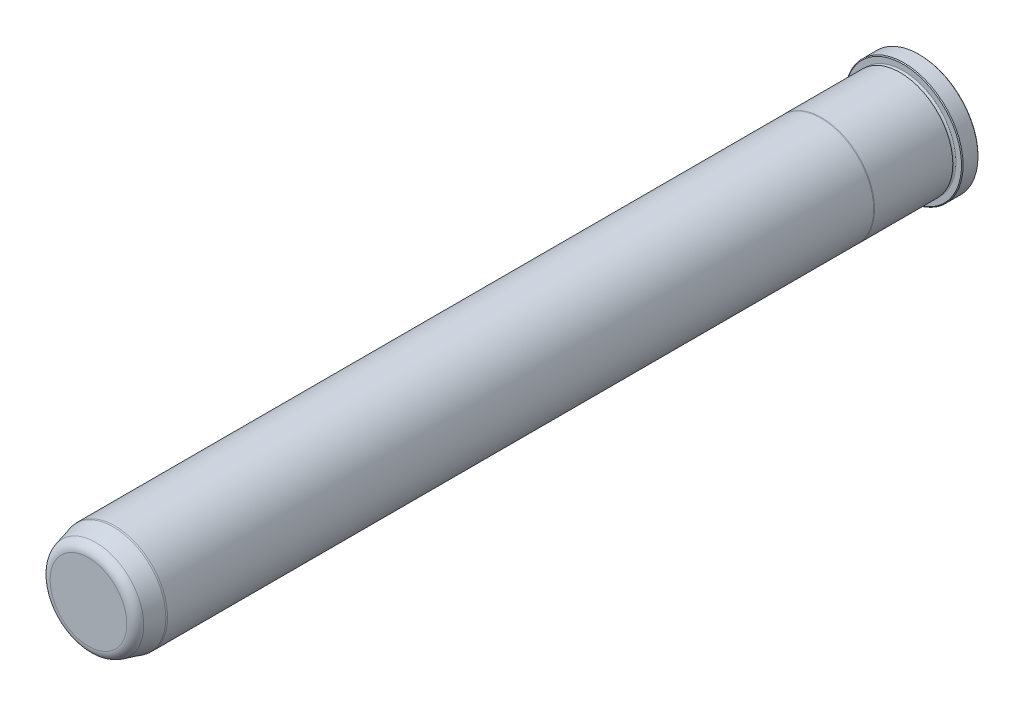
ISO-10303-21;
HEADER;
FILE_DESCRIPTION(('STEP AP214'),'2;1');
FILE_NAME('part.step','',(''),(''),'','','');
FILE_SCHEMA(('AUTOMOTIVE_DESIGN { 1 0 10303 214 1 1 1 1 }'));
ENDSEC;
DATA;
#1=APPLICATION_CONTEXT('core data for automotive mechanical design processes');
#2=APPLICATION_PROTOCOL_DEFINITION('international standard','automotive_design',2000,#1);
#3=PRODUCT_CONTEXT('',#1,'mechanical');
#4=PRODUCT('Part','Part','',(#3));
#5=PRODUCT_RELATED_PRODUCT_CATEGORY('part','',(#4));
#6=PRODUCT_DEFINITION_FORMATION('','',#4);
#7=PRODUCT_DEFINITION_CONTEXT('part definition',#1,'design');
#8=PRODUCT_DEFINITION('design','',#6,#7);
#9=PRODUCT_DEFINITION_SHAPE('','',#8);
#10=(LENGTH_UNIT() NAMED_UNIT(*) SI_UNIT(.MILLI.,.METRE.));
#11=(NAMED_UNIT(*) PLANE_ANGLE_UNIT() SI_UNIT($,.RADIAN.));
#12=(NAMED_UNIT(*) SI_UNIT($,.STERADIAN.) SOLID_ANGLE_UNIT());
#13=UNCERTAINTY_MEASURE_WITH_UNIT(LENGTH_MEASURE(1.E-05),#10,'distance_accuracy_value','');
#14=(GEOMETRIC_REPRESENTATION_CONTEXT(3) GLOBAL_UNCERTAINTY_ASSIGNED_CONTEXT((#13)) GLOBAL_UNIT_ASSIGNED_CONTEXT((#10,
#11,#12)) REPRESENTATION_CONTEXT('',''));
#15=CARTESIAN_POINT('',(0.,0.,0.));
#16=DIRECTION('',(0.,0.,1.));
#17=DIRECTION('',(1.,0.,0.));
#18=AXIS2_PLACEMENT_3D('',#15,#16,#17);
#19=CARTESIAN_POINT('',(0.,0.,0.));
#20=DIRECTION('',(0.,0.,1.));
#21=DIRECTION('',(1.,0.,0.));
#22=AXIS2_PLACEMENT_3D('',#19,#20,#21);
#23=PLANE('',#22);
#24=CARTESIAN_POINT('',(0.,0.,0.));
#25=DIRECTION('',(0.,0.,1.));
#26=DIRECTION('',(1.,0.,0.));
#27=AXIS2_PLACEMENT_3D('',#24,#25,#26);
#28=CIRCLE('',#27,28.067);
#29=CARTESIAN_POINT('',(28.067,0.,0.));
#30=VERTEX_POINT('',#29);
#31=EDGE_CURVE('E37',#30,#30,#28,.F.);
#32=ORIENTED_EDGE('',*,*,#31,.T.);
#33=EDGE_LOOP('',(#32));
#34=FACE_BOUND('',#33,.T.);
#35=ADVANCED_FACE('F30',(#34),#23,.F.);
#36=CARTESIAN_POINT('',(0.,0.,0.));
#37=DIRECTION('',(0.,0.,1.));
#38=DIRECTION('',(1.,0.,0.));
#39=AXIS2_PLACEMENT_3D('',#36,#37,#38);
#40=CYLINDRICAL_SURFACE('',#39,28.448);
#41=CARTESIAN_POINT('',(0.,0.,0.380999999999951));
#42=DIRECTION('',(0.,0.,1.));
#43=DIRECTION('',(1.,0.,0.));
#44=AXIS2_PLACEMENT_3D('',#41,#42,#43);
#45=CIRCLE('',#44,28.448);
#46=CARTESIAN_POINT('',(28.448,0.,0.380999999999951));
#47=VERTEX_POINT('',#46);
#48=EDGE_CURVE('E41',#47,#47,#45,.T.);
#49=ORIENTED_EDGE('',*,*,#48,.T.);
#50=EDGE_LOOP('',(#49));
#51=FACE_BOUND('',#50,.T.);
#52=CARTESIAN_POINT('',(0.,0.,7.54379999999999));
#53=DIRECTION('',(0.,0.,-1.));
#54=DIRECTION('',(-1.,0.,0.));
#55=AXIS2_PLACEMENT_3D('',#52,#53,#54);
#56=CIRCLE('',#55,28.448);
#57=CARTESIAN_POINT('',(-28.448,0.,7.54379999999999));
#58=VERTEX_POINT('',#57);
#59=EDGE_CURVE('E45',#58,#58,#56,.T.);
#60=ORIENTED_EDGE('',*,*,#59,.T.);
#61=EDGE_LOOP('',(#60));
#62=FACE_BOUND('',#61,.T.);
#63=ADVANCED_FACE('F118',(#51,#62),#40,.T.);
#64=CARTESIAN_POINT('',(0.,28.448,7.9248));
#65=DIRECTION('',(0.,0.,-1.));
#66=DIRECTION('',(-1.,0.,0.));
#67=AXIS2_PLACEMENT_3D('',#64,#65,#66);
#68=PLANE('',#67);
#69=CARTESIAN_POINT('',(0.,0.,7.9248));
#70=DIRECTION('',(0.,0.,-1.));
#71=DIRECTION('',(-1.,0.,0.));
#72=AXIS2_PLACEMENT_3D('',#69,#70,#71);
#73=CIRCLE('',#72,28.067);
#74=CARTESIAN_POINT('',(-28.067,0.,7.9248));
#75=VERTEX_POINT('',#74);
#76=EDGE_CURVE('E10',#75,#75,#73,.F.);
#77=ORIENTED_EDGE('',*,*,#76,.T.);
#78=EDGE_LOOP('',(#77));
#79=FACE_BOUND('',#78,.T.);
#80=CARTESIAN_POINT('',(0.,0.,7.9248));
#81=DIRECTION('',(0.,0.,1.));
#82=DIRECTION('',(1.,0.,0.));
#83=AXIS2_PLACEMENT_3D('',#80,#81,#82);
#84=CIRCLE('',#83,25.3873);
#85=CARTESIAN_POINT('',(25.3873,0.,7.9248));
#86=VERTEX_POINT('',#85);
#87=EDGE_CURVE('E56',#86,#86,#84,.T.);
#88=ORIENTED_EDGE('',*,*,#87,.F.);
#89=EDGE_LOOP('',(#88));
#90=FACE_BOUND('',#89,.T.);
#91=ADVANCED_FACE('F113',(#79,#90),#68,.F.);
#92=CARTESIAN_POINT('',(0.,0.,8.6868));
#93=DIRECTION('',(0.,0.,1.));
#94=DIRECTION('',(1.,0.,0.));
#95=AXIS2_PLACEMENT_3D('',#92,#93,#94);
#96=TOROIDAL_SURFACE('',#95,25.3873,0.761999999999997);
#97=CARTESIAN_POINT('',(0.,0.,9.44879999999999));
#98=DIRECTION('',(0.,0.,1.));
#99=DIRECTION('',(1.,0.,0.));
#100=AXIS2_PLACEMENT_3D('',#97,#98,#99);
#101=CIRCLE('',#100,25.3873);
#102=CARTESIAN_POINT('',(25.3873,0.,9.44879999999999));
#103=VERTEX_POINT('',#102);
#104=EDGE_CURVE('E59',#103,#103,#101,.T.);
#105=ORIENTED_EDGE('',*,*,#104,.F.);
#106=EDGE_LOOP('',(#105));
#107=FACE_BOUND('',#106,.T.);
#108=ORIENTED_EDGE('',*,*,#87,.T.);
#109=EDGE_LOOP('',(#108));
#110=FACE_BOUND('',#109,.T.);
#111=ADVANCED_FACE('F107',(#107,#110),#96,.F.);
#112=CARTESIAN_POINT('',(0.,25.3873,9.44879999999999));
#113=DIRECTION('',(0.,0.,1.));
#114=DIRECTION('',(1.,0.,0.));
#115=AXIS2_PLACEMENT_3D('',#112,#113,#114);
#116=PLANE('',#115);
#117=CARTESIAN_POINT('',(0.,0.,9.4488));
#118=DIRECTION('',(0.,0.,1.));
#119=DIRECTION('',(1.,0.,0.));
#120=AXIS2_PLACEMENT_3D('',#117,#118,#119);
#121=CIRCLE('',#120,25.4127);
#122=CARTESIAN_POINT('',(25.4127,0.,9.4488));
#123=VERTEX_POINT('',#122);
#124=EDGE_CURVE('E62',#123,#123,#121,.T.);
#125=ORIENTED_EDGE('',*,*,#124,.F.);
#126=EDGE_LOOP('',(#125));
#127=FACE_BOUND('',#126,.T.);
#128=ORIENTED_EDGE('',*,*,#104,.T.);
#129=EDGE_LOOP('',(#128));
#130=FACE_BOUND('',#129,.T.);
#131=ADVANCED_FACE('F101',(#127,#130),#116,.F.);
#132=CARTESIAN_POINT('',(0.,0.,0.));
#133=DIRECTION('',(0.,0.,1.));
#134=DIRECTION('',(1.,0.,0.));
#135=AXIS2_PLACEMENT_3D('',#132,#133,#134);
#136=CYLINDRICAL_SURFACE('',#135,25.4127);
#137=CARTESIAN_POINT('',(0.,0.,47.1347630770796));
#138=DIRECTION('',(0.,0.,1.));
#139=DIRECTION('',(1.,0.,0.));
#140=AXIS2_PLACEMENT_3D('',#137,#138,#139);
#141=CIRCLE('',#140,25.4127);
#142=CARTESIAN_POINT('',(25.4127,0.,47.1347630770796));
#143=VERTEX_POINT('',#142);
#144=EDGE_CURVE('E65',#143,#143,#141,.T.);
#145=ORIENTED_EDGE('',*,*,#144,.F.);
#146=EDGE_LOOP('',(#145));
#147=FACE_BOUND('',#146,.T.);
#148=ORIENTED_EDGE('',*,*,#124,.T.);
#149=EDGE_LOOP('',(#148));
#150=FACE_BOUND('',#149,.T.);
#151=ADVANCED_FACE('F95',(#147,#150),#136,.T.);
#152=CARTESIAN_POINT('',(0.,0.,47.1347630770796));
#153=DIRECTION('',(0.,0.,-1.));
#154=DIRECTION('',(-1.,0.,0.));
#155=AXIS2_PLACEMENT_3D('',#152,#153,#154);
#156=CONICAL_SURFACE('',#155,25.4127,0.0698131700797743);
#157=CARTESIAN_POINT('',(0.,0.,47.498));
#158=DIRECTION('',(0.,0.,1.));
#159=DIRECTION('',(1.,0.,0.));
#160=AXIS2_PLACEMENT_3D('',#157,#158,#159);
#161=CIRCLE('',#160,25.3873);
#162=CARTESIAN_POINT('',(25.3873,0.,47.498));
#163=VERTEX_POINT('',#162);
#164=EDGE_CURVE('E68',#163,#163,#161,.T.);
#165=ORIENTED_EDGE('',*,*,#164,.F.);
#166=EDGE_LOOP('',(#165));
#167=FACE_BOUND('',#166,.T.);
#168=ORIENTED_EDGE('',*,*,#144,.T.);
#169=EDGE_LOOP('',(#168));
#170=FACE_BOUND('',#169,.T.);
#171=ADVANCED_FACE('F89',(#167,#170),#156,.T.);
#172=CARTESIAN_POINT('',(0.,0.,0.));
#173=DIRECTION('',(0.,0.,1.));
#174=DIRECTION('',(1.,0.,0.));
#175=AXIS2_PLACEMENT_3D('',#172,#173,#174);
#176=CYLINDRICAL_SURFACE('',#175,25.3873);
#177=CARTESIAN_POINT('',(0.,0.,387.35));
#178=DIRECTION('',(0.,0.,1.));
#179=DIRECTION('',(1.,0.,0.));
#180=AXIS2_PLACEMENT_3D('',#177,#178,#179);
#181=CIRCLE('',#180,25.3873);
#182=CARTESIAN_POINT('',(25.3873,0.,387.35));
#183=VERTEX_POINT('',#182);
#184=EDGE_CURVE('E71',#183,#183,#181,.T.);
#185=ORIENTED_EDGE('',*,*,#184,.F.);
#186=EDGE_LOOP('',(#185));
#187=FACE_BOUND('',#186,.T.);
#188=ORIENTED_EDGE('',*,*,#164,.T.);
#189=EDGE_LOOP('',(#188));
#190=FACE_BOUND('',#189,.T.);
#191=ADVANCED_FACE('F83',(#187,#190),#176,.T.);
#192=CARTESIAN_POINT('',(0.,0.,387.35));
#193=DIRECTION('',(0.,0.,-1.));
#194=DIRECTION('',(-1.,0.,0.));
#195=AXIS2_PLACEMENT_3D('',#192,#193,#194);
#196=CONICAL_SURFACE('',#195,25.3873,0.0872664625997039);
#197=CARTESIAN_POINT('',(0.,0.,388.112));
#198=DIRECTION('',(0.,0.,1.));
#199=DIRECTION('',(1.,0.,0.));
#200=AXIS2_PLACEMENT_3D('',#197,#198,#199);
#201=CIRCLE('',#200,25.3206336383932);
#202=CARTESIAN_POINT('',(25.3206336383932,0.,388.112));
#203=VERTEX_POINT('',#202);
#204=EDGE_CURVE('E74',#203,#203,#201,.T.);
#205=ORIENTED_EDGE('',*,*,#204,.F.);
#206=EDGE_LOOP('',(#205));
#207=FACE_BOUND('',#206,.T.);
#208=ORIENTED_EDGE('',*,*,#184,.T.);
#209=EDGE_LOOP('',(#208));
#210=FACE_BOUND('',#209,.T.);
#211=ADVANCED_FACE('F80',(#207,#210),#196,.T.);
#212=CARTESIAN_POINT('',(0.,0.,388.112));
#213=DIRECTION('',(0.,0.,-1.));
#214=DIRECTION('',(-1.,0.,0.));
#215=AXIS2_PLACEMENT_3D('',#212,#213,#214);
#216=CONICAL_SURFACE('',#215,25.3206336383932,0.26179938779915);
#217=CARTESIAN_POINT('',(0.,0.,396.520125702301));
#218=DIRECTION('',(0.,0.,1.));
#219=DIRECTION('',(1.,0.,0.));
#220=AXIS2_PLACEMENT_3D('',#217,#218,#219);
#221=CIRCLE('',#220,23.0676831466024);
#222=CARTESIAN_POINT('',(23.0676831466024,0.,396.520125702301));
#223=VERTEX_POINT('',#222);
#224=EDGE_CURVE('E50',#223,#223,#221,.F.);
#225=ORIENTED_EDGE('',*,*,#224,.T.);
#226=EDGE_LOOP('',(#225));
#227=FACE_BOUND('',#226,.T.);
#228=ORIENTED_EDGE('',*,*,#204,.T.);
#229=EDGE_LOOP('',(#228));
#230=FACE_BOUND('',#229,.T.);
#231=ADVANCED_FACE('F78',(#227,#230),#216,.T.);
#232=CARTESIAN_POINT('',(0.,22.1218561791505,400.05));
#233=DIRECTION('',(0.,0.,-1.));
#234=DIRECTION('',(-1.,0.,0.));
#235=AXIS2_PLACEMENT_3D('',#232,#233,#234);
#236=PLANE('',#235);
#237=CARTESIAN_POINT('',(0.,0.,400.05));
#238=DIRECTION('',(0.,0.,-1.));
#239=DIRECTION('',(-1.,0.,0.));
#240=AXIS2_PLACEMENT_3D('',#237,#238,#239);
#241=CIRCLE('',#240,18.4674613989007);
#242=CARTESIAN_POINT('',(-18.4674613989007,0.,400.05));
#243=VERTEX_POINT('',#242);
#244=EDGE_CURVE('E53',#243,#243,#241,.F.);
#245=ORIENTED_EDGE('',*,*,#244,.T.);
#246=EDGE_LOOP('',(#245));
#247=FACE_BOUND('',#246,.T.);
#248=ADVANCED_FACE('F133',(#247),#236,.F.);
#249=CARTESIAN_POINT('',(0.,0.,395.2875));
#250=DIRECTION('',(0.,0.,-1.));
#251=DIRECTION('',(-1.,0.,0.));
#252=AXIS2_PLACEMENT_3D('',#249,#250,#251);
#253=TOROIDAL_SURFACE('',#252,18.4674613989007,4.7625);
#254=ORIENTED_EDGE('',*,*,#224,.F.);
#255=EDGE_LOOP('',(#254));
#256=FACE_BOUND('',#255,.T.);
#257=ORIENTED_EDGE('',*,*,#244,.F.);
#258=EDGE_LOOP('',(#257));
#259=FACE_BOUND('',#258,.T.);
#260=ADVANCED_FACE('F130',(#256,#259),#253,.T.);
#261=CARTESIAN_POINT('',(0.,0.,0.380999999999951));
#262=DIRECTION('',(0.,0.,1.));
#263=DIRECTION('',(1.,0.,0.));
#264=AXIS2_PLACEMENT_3D('',#261,#262,#263);
#265=CONICAL_SURFACE('',#264,28.448,0.785398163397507);
#266=ORIENTED_EDGE('',*,*,#31,.F.);
#267=EDGE_LOOP('',(#266));
#268=FACE_BOUND('',#267,.T.);
#269=ORIENTED_EDGE('',*,*,#48,.F.);
#270=EDGE_LOOP('',(#269));
#271=FACE_BOUND('',#270,.T.);
#272=ADVANCED_FACE('F132',(#268,#271),#265,.T.);
#273=CARTESIAN_POINT('',(0.,0.,7.9248));
#274=DIRECTION('',(0.,0.,-1.));
#275=DIRECTION('',(-1.,0.,0.));
#276=AXIS2_PLACEMENT_3D('',#273,#274,#275);
#277=CONICAL_SURFACE('',#276,28.067,0.785398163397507);
#278=CARTESIAN_POINT('',(-28.448,0.,7.54379999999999));
#279=CARTESIAN_POINT('',(-28.44403125,0.,7.54776874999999));
#280=CARTESIAN_POINT('',(-28.4400625,0.,7.55173749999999));
#281=CARTESIAN_POINT('',(-28.432125,0.,7.55967499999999));
#282=CARTESIAN_POINT('',(-28.42815625,0.,7.56364374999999));
#283=CARTESIAN_POINT('',(-28.42021875,0.,7.57158124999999));
#284=CARTESIAN_POINT('',(-28.41625,0.,7.57554999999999));
#285=CARTESIAN_POINT('',(-28.4083125,0.,7.58348749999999));
#286=CARTESIAN_POINT('',(-28.40434375,0.,7.58745624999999));
#287=CARTESIAN_POINT('',(-28.39640625,0.,7.59539374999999));
#288=CARTESIAN_POINT('',(-28.3924375,0.,7.59936249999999));
#289=CARTESIAN_POINT('',(-28.3845,0.,7.6073));
#290=CARTESIAN_POINT('',(-28.38053125,0.,7.61126875));
#291=CARTESIAN_POINT('',(-28.37259375,0.,7.61920624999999));
#292=CARTESIAN_POINT('',(-28.368625,0.,7.62317499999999));
#293=CARTESIAN_POINT('',(-28.3606875,0.,7.63111249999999));
#294=CARTESIAN_POINT('',(-28.35671875,0.,7.63508125));
#295=CARTESIAN_POINT('',(-28.34878125,0.,7.64301875));
#296=CARTESIAN_POINT('',(-28.3448125,0.,7.6469875));
#297=CARTESIAN_POINT('',(-28.336875,0.,7.654925));
#298=CARTESIAN_POINT('',(-28.33290625,0.,7.65889375));
#299=CARTESIAN_POINT('',(-28.32496875,0.,7.66683125));
#300=CARTESIAN_POINT('',(-28.321,0.,7.6708));
#301=CARTESIAN_POINT('',(-28.3130625,0.,7.6787375));
#302=CARTESIAN_POINT('',(-28.30909375,0.,7.68270625));
#303=CARTESIAN_POINT('',(-28.30115625,0.,7.69064375));
#304=CARTESIAN_POINT('',(-28.2971875,0.,7.6946125));
#305=CARTESIAN_POINT('',(-28.28925,0.,7.70255));
#306=CARTESIAN_POINT('',(-28.28528125,0.,7.70651875));
#307=CARTESIAN_POINT('',(-28.27734375,0.,7.71445625));
#308=CARTESIAN_POINT('',(-28.273375,0.,7.718425));
#309=CARTESIAN_POINT('',(-28.2654375,0.,7.7263625));
#310=CARTESIAN_POINT('',(-28.26146875,0.,7.73033125));
#311=CARTESIAN_POINT('',(-28.25353125,0.,7.73826875));
#312=CARTESIAN_POINT('',(-28.2495625,0.,7.7422375));
#313=CARTESIAN_POINT('',(-28.241625,0.,7.750175));
#314=CARTESIAN_POINT('',(-28.23765625,0.,7.75414375));
#315=CARTESIAN_POINT('',(-28.22971875,0.,7.76208125));
#316=CARTESIAN_POINT('',(-28.22575,0.,7.76605));
#317=CARTESIAN_POINT('',(-28.2178125,0.,7.7739875));
#318=CARTESIAN_POINT('',(-28.21384375,0.,7.77795625));
#319=CARTESIAN_POINT('',(-28.20590625,0.,7.78589375));
#320=CARTESIAN_POINT('',(-28.2019375,0.,7.7898625));
#321=CARTESIAN_POINT('',(-28.194,0.,7.7978));
#322=CARTESIAN_POINT('',(-28.19003125,0.,7.80176875));
#323=CARTESIAN_POINT('',(-28.18209375,0.,7.80970625));
#324=CARTESIAN_POINT('',(-28.178125,0.,7.813675));
#325=CARTESIAN_POINT('',(-28.1701875,0.,7.8216125));
#326=CARTESIAN_POINT('',(-28.16621875,0.,7.82558125));
#327=CARTESIAN_POINT('',(-28.15828125,0.,7.83351875));
#328=CARTESIAN_POINT('',(-28.1543125,0.,7.8374875));
#329=CARTESIAN_POINT('',(-28.146375,0.,7.845425));
#330=CARTESIAN_POINT('',(-28.14240625,0.,7.84939375));
#331=CARTESIAN_POINT('',(-28.13446875,0.,7.85733125));
#332=CARTESIAN_POINT('',(-28.1305,0.,7.8613));
#333=CARTESIAN_POINT('',(-28.1225625,0.,7.8692375));
#334=CARTESIAN_POINT('',(-28.11859375,0.,7.87320625));
#335=CARTESIAN_POINT('',(-28.11065625,0.,7.88114375));
#336=CARTESIAN_POINT('',(-28.1066875,0.,7.8851125));
#337=CARTESIAN_POINT('',(-28.09875,0.,7.89305));
#338=CARTESIAN_POINT('',(-28.09478125,0.,7.89701875));
#339=CARTESIAN_POINT('',(-28.08684375,0.,7.90495625));
#340=CARTESIAN_POINT('',(-28.082875,0.,7.908925));
#341=CARTESIAN_POINT('',(-28.0749375,0.,7.9168625));
#342=CARTESIAN_POINT('',(-28.07096875,0.,7.92083125));
#343=CARTESIAN_POINT('',(-28.067,0.,7.9248));
#344=B_SPLINE_CURVE_WITH_KNOTS('',3,(#278,#279,#280,#281,#282,#283,#284,#285,#286,#287,#288,
#289,#290,#291,#292,#293,#294,#295,#296,#297,#298,#299,#300,#301,#302,#303,#304,#305,#306,#307,
#308,#309,#310,#311,#312,#313,#314,#315,#316,#317,#318,#319,#320,#321,#322,#323,#324,#325,#326,
#327,#328,#329,#330,#331,#332,#333,#334,#335,#336,#337,#338,#339,#340,#341,#342,#343),
.UNSPECIFIED.,.F.,.F.,(4,2,2,2,2,2,2,2,2,2,2,2,2,2,2,2,2,2,2,2,2,2,2,2,2,2,2,2,2,2,2,2,4),(0.,
0.0168379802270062,0.033675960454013,0.0505139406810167,0.0673519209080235,0.0841899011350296,
0.101027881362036,0.117865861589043,0.134703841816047,0.151541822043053,0.16837980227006,
0.185217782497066,0.202055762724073,0.218893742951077,0.235731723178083,0.252569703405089,
0.269407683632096,0.2862456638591,0.303083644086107,0.319921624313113,0.33675960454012,
0.353597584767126,0.37043556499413,0.387273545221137,0.404111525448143,0.420949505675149,
0.437787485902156,0.45462546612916,0.471463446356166,0.488301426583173,0.50513940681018,
0.521977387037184,0.53881536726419),.UNSPECIFIED.);
#345=EDGE_CURVE('BSEAM32',#58,#75,#344,.T.);
#346=ORIENTED_EDGE('',*,*,#59,.F.);
#347=ORIENTED_EDGE('',*,*,#76,.F.);
#348=ORIENTED_EDGE('',*,*,#345,.T.);
#349=ORIENTED_EDGE('',*,*,#345,.F.);
#350=EDGE_LOOP('',(#346,#348,#347,#349));
#351=FACE_BOUND('',#350,.T.);
#352=ADVANCED_FACE('F32',(#351),#277,.T.);
#353=CLOSED_SHELL('',(#35,#63,#91,#111,#131,#151,#171,#191,#211,#231,#248,#260,#272,#352));
#354=MANIFOLD_SOLID_BREP('B2',#353);
#355=ADVANCED_BREP_SHAPE_REPRESENTATION('',(#18,#354),#14);
#356=SHAPE_DEFINITION_REPRESENTATION(#9,#355);
ENDSEC;
END-ISO-10303-21;
